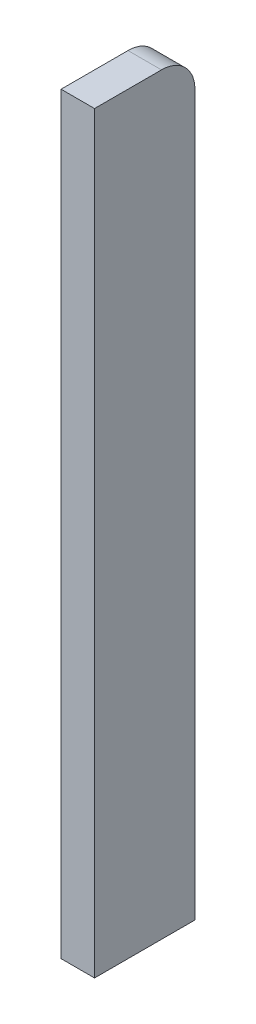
from build123d import *

# Parameters (mm, degrees)
SKETCH3_W      = 6.35
SKETCH3_H      = 142.875
EXTRUDE3_DEPTH = 19.05
FILLET1_R      = 6.35


with BuildPart() as part:
    # Sketch3 → Extrude3 (new body)
    with BuildSketch(Plane(origin=(0, 0, 0), x_dir=(-1, 0, 0), z_dir=(0, 0, -1))):
        with Locations((3.175, 71.4375)):
            Rectangle(SKETCH3_W, SKETCH3_H)
    extrude(amount=EXTRUDE3_DEPTH)

    # Fillet1
    fillet1_edges = [part.edges().sort_by_distance(p)[0] for p in [
        (-3.175, 142.875, -19.05),
    ]]
    fillet(fillet1_edges, radius=FILLET1_R)


solid = part.part
